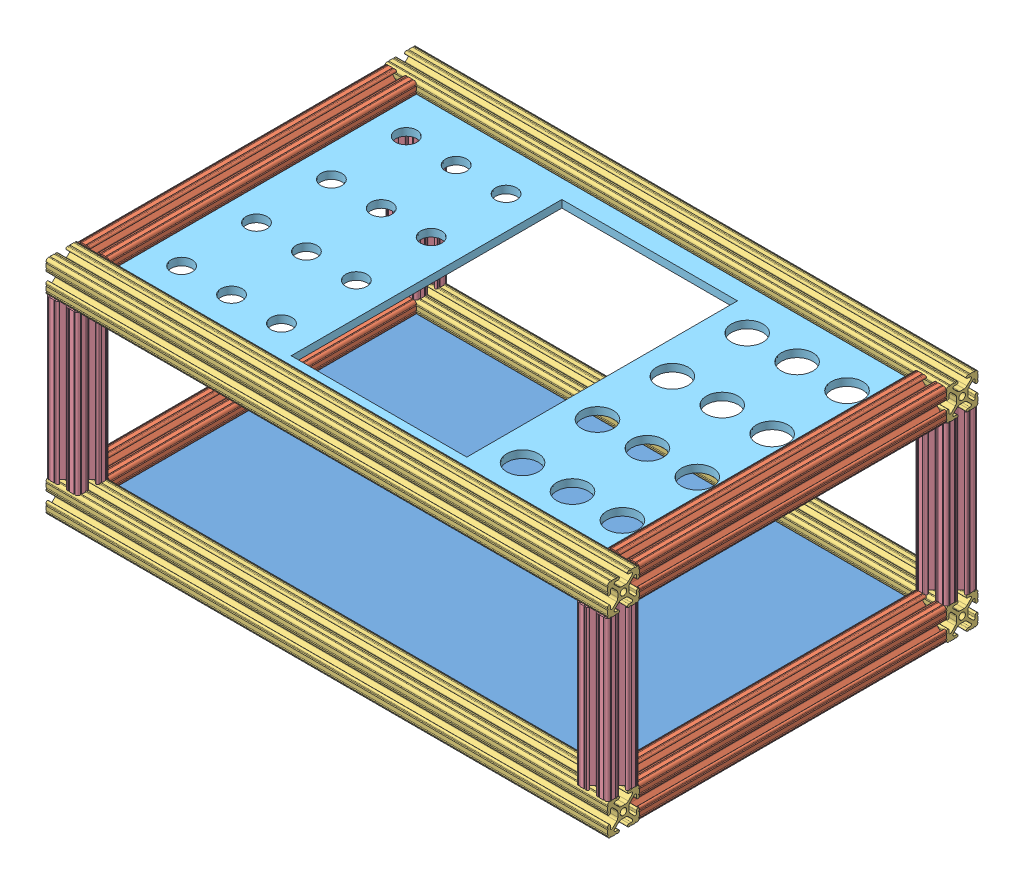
SolidWorks assembly PLC 2.0 assem.SLDASM, configuration Default (file format 12000). Lengths in mm.
Overall size (450 177.8 296.8).
15 component instances, 5 part files, 29 mates.
Components (placement in the parent):
- PLC board 2-1: PLC board 2.SLDPRT [Default] at origin size (413.2 6 260)
- 1010 -246mm-1: 1010 -246mm.SLDPRT [ 1010] at (211.1172 2.7488 121.8172) size (25.4 25.4 246)
- 1010 -246mm-2: 1010 -246mm.SLDPRT [ 1010] at (-213.4828 2.7488 121.8172) size (25.4 25.4 246)
- 1010 -450mm-1: 1010 -450mm.SLDPRT [ 1010] at (-226.1828 2.7488 134.5172) x (0 0 1) z (-1 0 0) size (25.4 25.4 450)
- 1010 -450mm-2: 1010 -450mm.SLDPRT [ 1010] at (-226.1828 2.7488 -136.8828) x (0 0 1) z (-1 0 0) size (25.4 25.4 450)
- 1010 -127mm-1: 1010 -127mm.SLDPRT [ 1010] at (-213.4828 15.4488 134.5172) x (1 0 0) z (0 -1 0) size (25.4 25.4 127)
- 1010 -127mm-2: 1010 -127mm.SLDPRT [ 1010] at (211.1172 15.4488 134.5172) x (1 0 0) z (0 -1 0) size (25.4 25.4 127)
- 1010 -127mm-3: 1010 -127mm.SLDPRT [ 1010] at (-213.4828 142.4488 -136.8828) x (1 0 0) z (0 1 0) size (25.4 25.4 127)
- 1010 -127mm-4: 1010 -127mm.SLDPRT [ 1010] at (211.1172 15.4488 -136.8828) x (1 0 0) z (0 -1 0) size (25.4 25.4 127)
- PLC 2.0 assem top-1: PLC 2.0 assem top.SLDASM [Default] at (-61.4369 -45.0322 -378.4258) size (450 25.4 296.8)
  - PLC board 1-1: PLC board 1.SLDPRT [Default] at (61.4816 197.1824 376.6069) size (413.2 6 260)
  - 1010 -246mm-1: 1010 -246mm.SLDPRT [ 1010] at (-152.0459 200.181 500.243) size (25.4 25.4 246)
  - 1010 -450mm-1: 1010 -450mm.SLDPRT [ 1010] at (285.2541 200.181 241.543) x (0 0 -1) z (1 0 0) size (25.4 25.4 450)
  - 1010 -246mm-2: 1010 -246mm.SLDPRT [ 1010] at (272.5541 200.181 500.243) size (25.4 25.4 246)
  - 1010 -450mm-3: 1010 -450mm.SLDPRT [ 1010] at (285.2541 200.181 512.943) x (0 -1 0) z (1 0 0) size (25.4 25.4 450)
Mates (geometry in assembly coordinates):
- Coincident1: coincident anti-aligned: plane of 1010 -246mm-2 through (-202.891 13.3406 121.8172) normal (0 0 1); plane of 1010 -450mm-1 through (223.8172 12.2992 121.8172) normal (0 0 -1)
- Coincident2: coincident: point of 1010 -246mm-2; point of 1010 -450mm-1
- Coincident3: coincident: point of 1010 -246mm-2; point of 1010 -450mm-1
- Coincident4: coincident anti-aligned: plane of 1010 -246mm-1 through (221.709 13.3406 121.8172) normal (0 0 1); plane of 1010 -450mm-1 through (223.8172 12.2992 121.8172) normal (0 0 -1)
- Coincident5: coincident: point of 1010 -246mm-1; point of 1010 -450mm-1
- Coincident6: coincident: point of 1010 -246mm-1; point of 1010 -450mm-1
- Coincident7: coincident anti-aligned: plane of 1010 -246mm-1 through (221.709 13.3406 -124.1828) normal (0 0 -1); plane of 1010 -450mm-2 through (223.8172 9.0734 -124.1828) normal (0 0 1)
- Coincident8: coincident: point of 1010 -246mm-1; point of 1010 -450mm-2
- Coincident9: coincident: point of 1010 -246mm-1; point of 1010 -450mm-2
- Coincident10: coincident anti-aligned: plane of 1010 -246mm-2 through (-202.891 13.3406 -124.1828) normal (0 0 -1); plane of 1010 -450mm-2 through (223.8172 9.0734 -124.1828) normal (0 0 1)
- Coincident11: coincident: point of 1010 -246mm-2; point of 1010 -450mm-2
- Coincident12: coincident: point of 1010 -246mm-2; point of 1010 -450mm-2
- Coincident13: coincident anti-aligned: plane of PLC board 2-1 through (206.6 6 130) normal (1 0 0); plane of 1010 -246mm-1 through (206.6 4.3884 -124.1828) normal (-1 0 0)
- Coincident14: coincident anti-aligned: plane of PLC board 2-1 through (-206.6 6 130) normal (0 0 1); plane of 1010 -450mm-1 through (223.8172 4.3884 130) normal (0 0 -1)
- Tangent1: tangent anti-aligned: plane of PLC board 2-1 through (0 6 0) normal (0 1 0); cylinder of 1010 -246mm-1 through (199.5221 7.1049 -124.1828) axis (0 0 1) radius 1.1049
- Coincident15: coincident anti-aligned: plane of 1010 -450mm-1 through (223.8172 15.4488 128.1926) normal (0 1 0); plane of 1010 -127mm-1 through (-202.891 15.4488 145.109) normal (0 -1 0)
- Coincident16: coincident: point of 1010 -450mm-1; point of 1010 -127mm-1
- Coincident17: coincident: point of 1010 -450mm-1; point of 1010 -127mm-1
- Coincident18: coincident anti-aligned: plane of 1010 -450mm-2 through (223.8172 15.4488 -143.2074) normal (0 1 0); plane of 1010 -127mm-3 through (-202.891 15.4488 -147.4746) normal (0 -1 0)
- Coincident19: coincident: point of 1010 -450mm-2; point of 1010 -127mm-3
- Coincident20: coincident anti-aligned: plane of 1010 -450mm-1 through (223.8172 15.4488 144.0676) normal (0 1 0); plane of 1010 -127mm-2 through (221.709 15.4488 145.109) normal (0 -1 0)
- Coincident21: coincident: point of 1010 -450mm-1; point of 1010 -127mm-2
- Coincident22: coincident: point of 1010 -450mm-1; point of 1010 -127mm-2
- Coincident23: coincident anti-aligned: plane of 1010 -450mm-2 through (223.8172 15.4488 -127.3324) normal (0 1 0); plane of 1010 -127mm-4 through (221.709 15.4488 -126.291) normal (0 -1 0)
- Coincident24: coincident: point of 1010 -450mm-2; point of 1010 -127mm-4
- Coincident25: coincident: point of 1010 -450mm-2; point of 1010 -127mm-4
- Coincident26: coincident anti-aligned: plane of 1010 -127mm-1 through (-202.891 142.4488 145.109) normal (0 1 0); plane of PLC 2.0 assem top-1/1010 -450mm-3 through (-226.1828 142.4488 144.0676) normal (0 -1 0)
- Coincident27: coincident: point of 1010 -127mm-1; point of PLC 2.0 assem top-1/1010 -450mm-3
- Coincident28: coincident: point of 1010 -127mm-1; point of PLC 2.0 assem top-1/1010 -450mm-3
